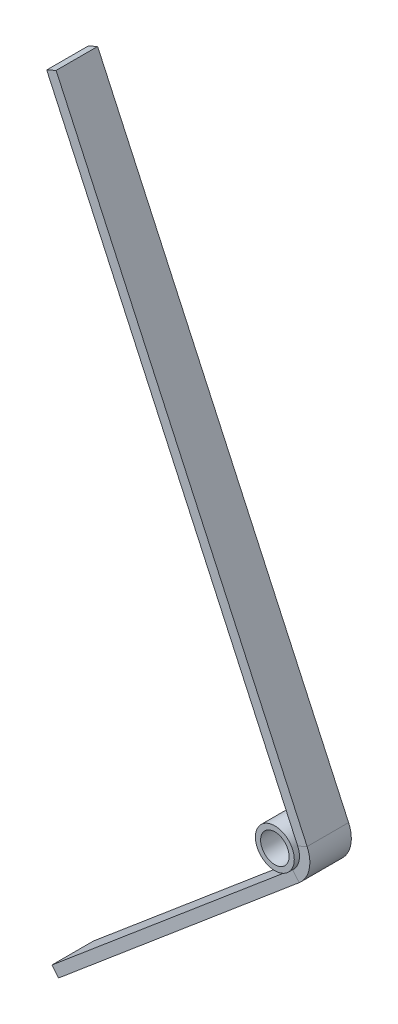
ISO-10303-21;
HEADER;
FILE_DESCRIPTION(('STEP AP214'),'2;1');
FILE_NAME('part.step','',(''),(''),'','','');
FILE_SCHEMA(('AUTOMOTIVE_DESIGN { 1 0 10303 214 1 1 1 1 }'));
ENDSEC;
DATA;
#1=APPLICATION_CONTEXT('core data for automotive mechanical design processes');
#2=APPLICATION_PROTOCOL_DEFINITION('international standard','automotive_design',2000,#1);
#3=PRODUCT_CONTEXT('',#1,'mechanical');
#4=PRODUCT('Part','Part','',(#3));
#5=PRODUCT_RELATED_PRODUCT_CATEGORY('part','',(#4));
#6=PRODUCT_DEFINITION_FORMATION('','',#4);
#7=PRODUCT_DEFINITION_CONTEXT('part definition',#1,'design');
#8=PRODUCT_DEFINITION('design','',#6,#7);
#9=PRODUCT_DEFINITION_SHAPE('','',#8);
#10=(LENGTH_UNIT() NAMED_UNIT(*) SI_UNIT(.MILLI.,.METRE.));
#11=(NAMED_UNIT(*) PLANE_ANGLE_UNIT() SI_UNIT($,.RADIAN.));
#12=(NAMED_UNIT(*) SI_UNIT($,.STERADIAN.) SOLID_ANGLE_UNIT());
#13=UNCERTAINTY_MEASURE_WITH_UNIT(LENGTH_MEASURE(1.E-05),#10,'distance_accuracy_value','');
#14=(GEOMETRIC_REPRESENTATION_CONTEXT(3) GLOBAL_UNCERTAINTY_ASSIGNED_CONTEXT((#13)) GLOBAL_UNIT_ASSIGNED_CONTEXT((#10,
#11,#12)) REPRESENTATION_CONTEXT('',''));
#15=CARTESIAN_POINT('',(0.,0.,0.));
#16=DIRECTION('',(0.,0.,1.));
#17=DIRECTION('',(1.,0.,0.));
#18=AXIS2_PLACEMENT_3D('',#15,#16,#17);
#19=CARTESIAN_POINT('',(10.8203069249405,4.96787148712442,12.7));
#20=DIRECTION('',(0.,0.,1.));
#21=DIRECTION('',(1.,0.,0.));
#22=AXIS2_PLACEMENT_3D('',#19,#20,#21);
#23=PLANE('',#22);
#24=DIRECTION('',(0.908792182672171,0.417249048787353,0.));
#25=VECTOR('',#24,1.);
#26=CARTESIAN_POINT('',(10.8203069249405,4.96787148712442,12.7));
#27=LINE('',#26,#25);
#28=CARTESIAN_POINT('',(10.8203069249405,4.96787148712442,12.7));
#29=VERTEX_POINT('',#28);
#30=CARTESIAN_POINT('',(16.5911372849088,7.61740294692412,12.7));
#31=VERTEX_POINT('',#30);
#32=EDGE_CURVE('E12',#29,#31,#27,.T.);
#33=ORIENTED_EDGE('',*,*,#32,.F.);
#34=CARTESIAN_POINT('',(0.,0.,12.7));
#35=DIRECTION('',(0.,0.,-1.));
#36=DIRECTION('',(1.,0.,0.));
#37=AXIS2_PLACEMENT_3D('',#34,#35,#36);
#38=CIRCLE('',#37,11.90625);
#39=CARTESIAN_POINT('',(7.67438496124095,-9.1028898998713,12.7));
#40=VERTEX_POINT('',#39);
#41=EDGE_CURVE('E141',#29,#40,#38,.T.);
#42=ORIENTED_EDGE('',*,*,#41,.T.);
#43=DIRECTION('',(-0.644567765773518,0.764547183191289,0.));
#44=VECTOR('',#43,1.);
#45=CARTESIAN_POINT('',(11.7673902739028,-13.957764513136,12.7));
#46=LINE('',#45,#44);
#47=CARTESIAN_POINT('',(11.7673902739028,-13.957764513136,12.7));
#48=VERTEX_POINT('',#47);
#49=EDGE_CURVE('E62',#48,#40,#46,.T.);
#50=ORIENTED_EDGE('',*,*,#49,.F.);
#51=CARTESIAN_POINT('',(0.,0.,12.7));
#52=DIRECTION('',(0.,0.,1.));
#53=DIRECTION('',(1.,0.,0.));
#54=AXIS2_PLACEMENT_3D('',#51,#52,#53);
#55=CIRCLE('',#54,18.25625);
#56=EDGE_CURVE('E148',#31,#48,#55,.F.);
#57=ORIENTED_EDGE('',*,*,#56,.F.);
#58=EDGE_LOOP('',(#33,#42,#50,#57));
#59=FACE_BOUND('',#58,.T.);
#60=ADVANCED_FACE('F52',(#59),#23,.T.);
#61=CARTESIAN_POINT('',(11.7673902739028,-13.957764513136,12.7));
#62=DIRECTION('',(0.,0.,1.));
#63=DIRECTION('',(1.,0.,0.));
#64=AXIS2_PLACEMENT_3D('',#61,#62,#63);
#65=PLANE('',#64);
#66=DIRECTION('',(0.41724904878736,-0.908792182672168,0.));
#67=VECTOR('',#66,1.);
#68=CARTESIAN_POINT('',(10.8203069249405,4.96787148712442,12.7));
#69=LINE('',#68,#67);
#70=CARTESIAN_POINT('',(-142.875,339.725,12.7));
#71=VERTEX_POINT('',#70);
#72=EDGE_CURVE('E136',#71,#29,#69,.T.);
#73=ORIENTED_EDGE('',*,*,#72,.T.);
#74=ORIENTED_EDGE('',*,*,#32,.T.);
#75=DIRECTION('',(0.41724904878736,-0.908792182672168,0.));
#76=VECTOR('',#75,1.);
#77=CARTESIAN_POINT('',(16.5911372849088,7.61740294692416,12.7));
#78=LINE('',#77,#76);
#79=CARTESIAN_POINT('',(-137.104169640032,342.3745314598,12.7));
#80=VERTEX_POINT('',#79);
#81=EDGE_CURVE('E149',#80,#31,#78,.T.);
#82=ORIENTED_EDGE('',*,*,#81,.F.);
#83=DIRECTION('',(0.908792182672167,0.417249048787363,0.));
#84=VECTOR('',#83,1.);
#85=CARTESIAN_POINT('',(-142.875,339.725,12.7));
#86=LINE('',#85,#84);
#87=EDGE_CURVE('E126',#71,#80,#86,.T.);
#88=ORIENTED_EDGE('',*,*,#87,.F.);
#89=EDGE_LOOP('',(#73,#74,#82,#88));
#90=FACE_BOUND('',#89,.T.);
#91=ADVANCED_FACE('F147',(#90),#65,.T.);
#92=CARTESIAN_POINT('',(7.67438496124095,-9.1028898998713,-12.7));
#93=DIRECTION('',(0.,0.,-1.));
#94=DIRECTION('',(-1.,0.,0.));
#95=AXIS2_PLACEMENT_3D('',#92,#93,#94);
#96=PLANE('',#95);
#97=DIRECTION('',(0.644567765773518,-0.764547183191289,0.));
#98=VECTOR('',#97,1.);
#99=CARTESIAN_POINT('',(7.67438496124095,-9.1028898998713,-12.7));
#100=LINE('',#99,#98);
#101=CARTESIAN_POINT('',(7.67438496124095,-9.1028898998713,-12.7));
#102=VERTEX_POINT('',#101);
#103=CARTESIAN_POINT('',(11.7673902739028,-13.957764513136,-12.7));
#104=VERTEX_POINT('',#103);
#105=EDGE_CURVE('E104',#102,#104,#100,.T.);
#106=ORIENTED_EDGE('',*,*,#105,.F.);
#107=CARTESIAN_POINT('',(0.,0.,-12.7));
#108=DIRECTION('',(0.,0.,-1.));
#109=DIRECTION('',(1.,0.,0.));
#110=AXIS2_PLACEMENT_3D('',#107,#108,#109);
#111=CIRCLE('',#110,11.90625);
#112=CARTESIAN_POINT('',(10.8203069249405,4.96787148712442,-12.7));
#113=VERTEX_POINT('',#112);
#114=EDGE_CURVE('E175',#113,#102,#111,.T.);
#115=ORIENTED_EDGE('',*,*,#114,.F.);
#116=DIRECTION('',(-0.908792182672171,-0.417249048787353,0.));
#117=VECTOR('',#116,1.);
#118=CARTESIAN_POINT('',(16.5911372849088,7.61740294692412,-12.7));
#119=LINE('',#118,#117);
#120=CARTESIAN_POINT('',(16.5911372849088,7.61740294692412,-12.7));
#121=VERTEX_POINT('',#120);
#122=EDGE_CURVE('E97',#121,#113,#119,.T.);
#123=ORIENTED_EDGE('',*,*,#122,.F.);
#124=CARTESIAN_POINT('',(0.,0.,-12.7));
#125=DIRECTION('',(0.,0.,1.));
#126=DIRECTION('',(1.,0.,0.));
#127=AXIS2_PLACEMENT_3D('',#124,#125,#126);
#128=CIRCLE('',#127,18.25625);
#129=EDGE_CURVE('E164',#121,#104,#128,.F.);
#130=ORIENTED_EDGE('',*,*,#129,.T.);
#131=EDGE_LOOP('',(#106,#115,#123,#130));
#132=FACE_BOUND('',#131,.T.);
#133=ADVANCED_FACE('F202',(#132),#96,.T.);
#134=CARTESIAN_POINT('',(16.5911372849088,7.61740294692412,-12.7));
#135=DIRECTION('',(0.,0.,-1.));
#136=DIRECTION('',(-1.,0.,0.));
#137=AXIS2_PLACEMENT_3D('',#134,#135,#136);
#138=PLANE('',#137);
#139=DIRECTION('',(-0.764547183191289,-0.644567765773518,0.));
#140=VECTOR('',#139,1.);
#141=CARTESIAN_POINT('',(7.67438496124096,-9.1028898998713,-12.7));
#142=LINE('',#141,#140);
#143=CARTESIAN_POINT('',(-139.699999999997,-133.35,-12.7));
#144=VERTEX_POINT('',#143);
#145=EDGE_CURVE('E158',#102,#144,#142,.T.);
#146=ORIENTED_EDGE('',*,*,#145,.F.);
#147=ORIENTED_EDGE('',*,*,#105,.T.);
#148=DIRECTION('',(-0.764547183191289,-0.644567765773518,0.));
#149=VECTOR('',#148,1.);
#150=CARTESIAN_POINT('',(11.7673902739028,-13.957764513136,-12.7));
#151=LINE('',#150,#149);
#152=CARTESIAN_POINT('',(-135.606994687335,-138.204874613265,-12.7));
#153=VERTEX_POINT('',#152);
#154=EDGE_CURVE('E162',#104,#153,#151,.T.);
#155=ORIENTED_EDGE('',*,*,#154,.T.);
#156=DIRECTION('',(-0.644567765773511,0.764547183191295,0.));
#157=VECTOR('',#156,1.);
#158=CARTESIAN_POINT('',(-135.606994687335,-138.204874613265,-12.7));
#159=LINE('',#158,#157);
#160=EDGE_CURVE('E159',#153,#144,#159,.T.);
#161=ORIENTED_EDGE('',*,*,#160,.T.);
#162=EDGE_LOOP('',(#146,#147,#155,#161));
#163=FACE_BOUND('',#162,.T.);
#164=ADVANCED_FACE('F192',(#163),#138,.T.);
#165=CARTESIAN_POINT('',(7.67438496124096,-9.1028898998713,12.7));
#166=DIRECTION('',(0.644567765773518,-0.764547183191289,0.));
#167=DIRECTION('',(0.764547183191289,0.644567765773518,0.));
#168=AXIS2_PLACEMENT_3D('',#165,#166,#167);
#169=PLANE('',#168);
#170=ORIENTED_EDGE('',*,*,#145,.T.);
#171=DIRECTION('',(0.,0.,-1.));
#172=VECTOR('',#171,1.);
#173=CARTESIAN_POINT('',(-139.699999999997,-133.35,12.7));
#174=LINE('',#173,#172);
#175=CARTESIAN_POINT('',(-139.699999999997,-133.35,12.7));
#176=VERTEX_POINT('',#175);
#177=EDGE_CURVE('E187',#176,#144,#174,.T.);
#178=ORIENTED_EDGE('',*,*,#177,.F.);
#179=DIRECTION('',(-0.764547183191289,-0.644567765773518,0.));
#180=VECTOR('',#179,1.);
#181=CARTESIAN_POINT('',(7.67438496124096,-9.1028898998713,12.7));
#182=LINE('',#181,#180);
#183=EDGE_CURVE('E109',#40,#176,#182,.T.);
#184=ORIENTED_EDGE('',*,*,#183,.F.);
#185=DIRECTION('',(0.,0.,-1.));
#186=VECTOR('',#185,1.);
#187=CARTESIAN_POINT('',(7.67438496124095,-9.1028898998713,12.7));
#188=LINE('',#187,#186);
#189=EDGE_CURVE('E153',#40,#102,#188,.T.);
#190=ORIENTED_EDGE('',*,*,#189,.T.);
#191=EDGE_LOOP('',(#170,#178,#184,#190));
#192=FACE_BOUND('',#191,.T.);
#193=ADVANCED_FACE('F239',(#192),#169,.F.);
#194=CARTESIAN_POINT('',(-135.606994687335,-138.204874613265,12.7));
#195=DIRECTION('',(-0.764547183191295,-0.644567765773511,0.));
#196=DIRECTION('',(0.644567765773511,-0.764547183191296,0.));
#197=AXIS2_PLACEMENT_3D('',#194,#195,#196);
#198=PLANE('',#197);
#199=ORIENTED_EDGE('',*,*,#160,.F.);
#200=DIRECTION('',(0.,0.,-1.));
#201=VECTOR('',#200,1.);
#202=CARTESIAN_POINT('',(-135.606994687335,-138.204874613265,12.7));
#203=LINE('',#202,#201);
#204=CARTESIAN_POINT('',(-135.606994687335,-138.204874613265,12.7));
#205=VERTEX_POINT('',#204);
#206=EDGE_CURVE('E183',#205,#153,#203,.T.);
#207=ORIENTED_EDGE('',*,*,#206,.F.);
#208=DIRECTION('',(-0.644567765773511,0.764547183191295,0.));
#209=VECTOR('',#208,1.);
#210=CARTESIAN_POINT('',(-135.606994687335,-138.204874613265,12.7));
#211=LINE('',#210,#209);
#212=EDGE_CURVE('E208',#205,#176,#211,.T.);
#213=ORIENTED_EDGE('',*,*,#212,.T.);
#214=ORIENTED_EDGE('',*,*,#177,.T.);
#215=EDGE_LOOP('',(#199,#207,#213,#214));
#216=FACE_BOUND('',#215,.T.);
#217=ADVANCED_FACE('F217',(#216),#198,.T.);
#218=CARTESIAN_POINT('',(11.7673902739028,-13.957764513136,12.7));
#219=DIRECTION('',(0.644567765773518,-0.764547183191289,0.));
#220=DIRECTION('',(0.764547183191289,0.644567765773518,0.));
#221=AXIS2_PLACEMENT_3D('',#218,#219,#220);
#222=PLANE('',#221);
#223=ORIENTED_EDGE('',*,*,#154,.F.);
#224=DIRECTION('',(0.,0.,-1.));
#225=VECTOR('',#224,1.);
#226=CARTESIAN_POINT('',(11.7673902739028,-13.957764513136,12.7));
#227=LINE('',#226,#225);
#228=EDGE_CURVE('E181',#48,#104,#227,.T.);
#229=ORIENTED_EDGE('',*,*,#228,.F.);
#230=DIRECTION('',(-0.764547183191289,-0.644567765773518,0.));
#231=VECTOR('',#230,1.);
#232=CARTESIAN_POINT('',(11.7673902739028,-13.957764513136,12.7));
#233=LINE('',#232,#231);
#234=EDGE_CURVE('E209',#48,#205,#233,.T.);
#235=ORIENTED_EDGE('',*,*,#234,.T.);
#236=ORIENTED_EDGE('',*,*,#206,.T.);
#237=EDGE_LOOP('',(#223,#229,#235,#236));
#238=FACE_BOUND('',#237,.T.);
#239=ADVANCED_FACE('F205',(#238),#222,.T.);
#240=CARTESIAN_POINT('',(0.,0.,12.7));
#241=DIRECTION('',(0.,0.,-1.));
#242=DIRECTION('',(-1.,0.,0.));
#243=AXIS2_PLACEMENT_3D('',#240,#241,#242);
#244=CYLINDRICAL_SURFACE('',#243,18.25625);
#245=ORIENTED_EDGE('',*,*,#129,.F.);
#246=DIRECTION('',(0.,0.,-1.));
#247=VECTOR('',#246,1.);
#248=CARTESIAN_POINT('',(16.5911372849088,7.61740294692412,12.7));
#249=LINE('',#248,#247);
#250=EDGE_CURVE('E178',#31,#121,#249,.T.);
#251=ORIENTED_EDGE('',*,*,#250,.F.);
#252=ORIENTED_EDGE('',*,*,#56,.T.);
#253=ORIENTED_EDGE('',*,*,#228,.T.);
#254=EDGE_LOOP('',(#245,#251,#252,#253));
#255=FACE_BOUND('',#254,.T.);
#256=ADVANCED_FACE('F199',(#255),#244,.T.);
#257=CARTESIAN_POINT('',(16.5911372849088,7.61740294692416,12.7));
#258=DIRECTION('',(0.908792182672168,0.41724904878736,0.));
#259=DIRECTION('',(-0.41724904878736,0.908792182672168,0.));
#260=AXIS2_PLACEMENT_3D('',#257,#258,#259);
#261=PLANE('',#260);
#262=DIRECTION('',(0.41724904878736,-0.908792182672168,0.));
#263=VECTOR('',#262,1.);
#264=CARTESIAN_POINT('',(16.5911372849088,7.61740294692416,-12.7));
#265=LINE('',#264,#263);
#266=CARTESIAN_POINT('',(-137.104169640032,342.3745314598,-12.7));
#267=VERTEX_POINT('',#266);
#268=EDGE_CURVE('E170',#267,#121,#265,.T.);
#269=ORIENTED_EDGE('',*,*,#268,.F.);
#270=DIRECTION('',(0.,0.,-1.));
#271=VECTOR('',#270,1.);
#272=CARTESIAN_POINT('',(-137.104169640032,342.3745314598,12.7));
#273=LINE('',#272,#271);
#274=EDGE_CURVE('E135',#80,#267,#273,.T.);
#275=ORIENTED_EDGE('',*,*,#274,.F.);
#276=ORIENTED_EDGE('',*,*,#81,.T.);
#277=ORIENTED_EDGE('',*,*,#250,.T.);
#278=EDGE_LOOP('',(#269,#275,#276,#277));
#279=FACE_BOUND('',#278,.T.);
#280=ADVANCED_FACE('F210',(#279),#261,.T.);
#281=CARTESIAN_POINT('',(-142.875,339.725,12.7));
#282=DIRECTION('',(-0.417249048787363,0.908792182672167,0.));
#283=DIRECTION('',(-0.908792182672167,-0.417249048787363,0.));
#284=AXIS2_PLACEMENT_3D('',#281,#282,#283);
#285=PLANE('',#284);
#286=DIRECTION('',(0.908792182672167,0.417249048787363,0.));
#287=VECTOR('',#286,1.);
#288=CARTESIAN_POINT('',(-142.875,339.725,-12.7));
#289=LINE('',#288,#287);
#290=CARTESIAN_POINT('',(-142.875,339.725,-12.7));
#291=VERTEX_POINT('',#290);
#292=EDGE_CURVE('E132',#291,#267,#289,.T.);
#293=ORIENTED_EDGE('',*,*,#292,.F.);
#294=DIRECTION('',(0.,0.,-1.));
#295=VECTOR('',#294,1.);
#296=CARTESIAN_POINT('',(-142.875,339.725,12.7));
#297=LINE('',#296,#295);
#298=EDGE_CURVE('E123',#71,#291,#297,.T.);
#299=ORIENTED_EDGE('',*,*,#298,.F.);
#300=ORIENTED_EDGE('',*,*,#87,.T.);
#301=ORIENTED_EDGE('',*,*,#274,.T.);
#302=EDGE_LOOP('',(#293,#299,#300,#301));
#303=FACE_BOUND('',#302,.T.);
#304=ADVANCED_FACE('F130',(#303),#285,.T.);
#305=CARTESIAN_POINT('',(10.8203069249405,4.96787148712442,12.7));
#306=DIRECTION('',(0.908792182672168,0.41724904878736,0.));
#307=DIRECTION('',(-0.41724904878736,0.908792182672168,0.));
#308=AXIS2_PLACEMENT_3D('',#305,#306,#307);
#309=PLANE('',#308);
#310=DIRECTION('',(0.41724904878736,-0.908792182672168,0.));
#311=VECTOR('',#310,1.);
#312=CARTESIAN_POINT('',(10.8203069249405,4.96787148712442,-12.7));
#313=LINE('',#312,#311);
#314=EDGE_CURVE('E167',#291,#113,#313,.T.);
#315=ORIENTED_EDGE('',*,*,#314,.T.);
#316=DIRECTION('',(0.,0.,-1.));
#317=VECTOR('',#316,1.);
#318=CARTESIAN_POINT('',(10.8203069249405,4.96787148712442,12.7));
#319=LINE('',#318,#317);
#320=EDGE_CURVE('E131',#29,#113,#319,.T.);
#321=ORIENTED_EDGE('',*,*,#320,.F.);
#322=ORIENTED_EDGE('',*,*,#72,.F.);
#323=ORIENTED_EDGE('',*,*,#298,.T.);
#324=EDGE_LOOP('',(#315,#321,#322,#323));
#325=FACE_BOUND('',#324,.T.);
#326=ADVANCED_FACE('F137',(#325),#309,.F.);
#327=CARTESIAN_POINT('',(0.,0.,12.7));
#328=DIRECTION('',(0.,0.,-1.));
#329=DIRECTION('',(-1.,0.,0.));
#330=AXIS2_PLACEMENT_3D('',#327,#328,#329);
#331=CYLINDRICAL_SURFACE('',#330,11.90625);
#332=ORIENTED_EDGE('',*,*,#114,.T.);
#333=ORIENTED_EDGE('',*,*,#189,.F.);
#334=ORIENTED_EDGE('',*,*,#41,.F.);
#335=ORIENTED_EDGE('',*,*,#320,.T.);
#336=EDGE_LOOP('',(#332,#333,#334,#335));
#337=FACE_BOUND('',#336,.T.);
#338=ADVANCED_FACE('F218',(#337),#331,.F.);
#339=CARTESIAN_POINT('',(0.,0.,12.7));
#340=DIRECTION('',(0.,0.,1.));
#341=DIRECTION('',(1.,0.,0.));
#342=AXIS2_PLACEMENT_3D('',#339,#340,#341);
#343=PLANE('',#342);
#344=ORIENTED_EDGE('',*,*,#183,.T.);
#345=ORIENTED_EDGE('',*,*,#212,.F.);
#346=ORIENTED_EDGE('',*,*,#234,.F.);
#347=ORIENTED_EDGE('',*,*,#49,.T.);
#348=EDGE_LOOP('',(#344,#345,#346,#347));
#349=FACE_BOUND('',#348,.T.);
#350=ADVANCED_FACE('F219',(#349),#343,.T.);
#351=CARTESIAN_POINT('',(0.,0.,-12.7));
#352=DIRECTION('',(0.,0.,1.));
#353=DIRECTION('',(1.,0.,0.));
#354=AXIS2_PLACEMENT_3D('',#351,#352,#353);
#355=PLANE('',#354);
#356=ORIENTED_EDGE('',*,*,#268,.T.);
#357=ORIENTED_EDGE('',*,*,#122,.T.);
#358=ORIENTED_EDGE('',*,*,#314,.F.);
#359=ORIENTED_EDGE('',*,*,#292,.T.);
#360=EDGE_LOOP('',(#356,#357,#358,#359));
#361=FACE_BOUND('',#360,.T.);
#362=ADVANCED_FACE('F216',(#361),#355,.F.);
#363=CLOSED_SHELL('',(#60,#91,#133,#164,#193,#217,#239,#256,#280,#304,#326,#338,#350,#362));
#364=MANIFOLD_SOLID_BREP('B2',#363);
#365=CARTESIAN_POINT('',(0.,0.,15.875));
#366=DIRECTION('',(0.,0.,1.));
#367=DIRECTION('',(1.,0.,0.));
#368=AXIS2_PLACEMENT_3D('',#365,#366,#367);
#369=PLANE('',#368);
#370=CARTESIAN_POINT('',(0.,0.,15.875));
#371=DIRECTION('',(0.,0.,1.));
#372=DIRECTION('',(1.,0.,0.));
#373=AXIS2_PLACEMENT_3D('',#370,#371,#372);
#374=CIRCLE('',#373,11.90625);
#375=CARTESIAN_POINT('',(11.90625,0.,15.875));
#376=VERTEX_POINT('',#375);
#377=EDGE_CURVE('E55',#376,#376,#374,.T.);
#378=ORIENTED_EDGE('',*,*,#377,.T.);
#379=EDGE_LOOP('',(#378));
#380=FACE_BOUND('',#379,.T.);
#381=CARTESIAN_POINT('',(0.,0.,15.875));
#382=DIRECTION('',(0.,0.,1.));
#383=DIRECTION('',(1.,0.,0.));
#384=AXIS2_PLACEMENT_3D('',#381,#382,#383);
#385=CIRCLE('',#384,8.73125);
#386=CARTESIAN_POINT('',(8.73125,0.,15.875));
#387=VERTEX_POINT('',#386);
#388=EDGE_CURVE('E350',#387,#387,#385,.T.);
#389=ORIENTED_EDGE('',*,*,#388,.F.);
#390=EDGE_LOOP('',(#389));
#391=FACE_BOUND('',#390,.T.);
#392=ADVANCED_FACE('F340',(#380,#391),#369,.T.);
#393=CARTESIAN_POINT('',(0.,0.,-15.875));
#394=DIRECTION('',(0.,0.,1.));
#395=DIRECTION('',(1.,0.,0.));
#396=AXIS2_PLACEMENT_3D('',#393,#394,#395);
#397=PLANE('',#396);
#398=CARTESIAN_POINT('',(0.,0.,-15.875));
#399=DIRECTION('',(0.,0.,1.));
#400=DIRECTION('',(1.,0.,0.));
#401=AXIS2_PLACEMENT_3D('',#398,#399,#400);
#402=CIRCLE('',#401,11.90625);
#403=CARTESIAN_POINT('',(11.90625,0.,-15.875));
#404=VERTEX_POINT('',#403);
#405=EDGE_CURVE('E342',#404,#404,#402,.T.);
#406=ORIENTED_EDGE('',*,*,#405,.F.);
#407=EDGE_LOOP('',(#406));
#408=FACE_BOUND('',#407,.T.);
#409=CARTESIAN_POINT('',(0.,0.,-15.875));
#410=DIRECTION('',(0.,0.,1.));
#411=DIRECTION('',(1.,0.,0.));
#412=AXIS2_PLACEMENT_3D('',#409,#410,#411);
#413=CIRCLE('',#412,8.73125);
#414=CARTESIAN_POINT('',(8.73125,0.,-15.875));
#415=VERTEX_POINT('',#414);
#416=EDGE_CURVE('E348',#415,#415,#413,.T.);
#417=ORIENTED_EDGE('',*,*,#416,.T.);
#418=EDGE_LOOP('',(#417));
#419=FACE_BOUND('',#418,.T.);
#420=ADVANCED_FACE('F359',(#408,#419),#397,.F.);
#421=CARTESIAN_POINT('',(0.,0.,15.875));
#422=DIRECTION('',(0.,0.,-1.));
#423=DIRECTION('',(-1.,0.,0.));
#424=AXIS2_PLACEMENT_3D('',#421,#422,#423);
#425=CYLINDRICAL_SURFACE('',#424,11.90625);
#426=ORIENTED_EDGE('',*,*,#377,.F.);
#427=EDGE_LOOP('',(#426));
#428=FACE_BOUND('',#427,.T.);
#429=ORIENTED_EDGE('',*,*,#405,.T.);
#430=EDGE_LOOP('',(#429));
#431=FACE_BOUND('',#430,.T.);
#432=ADVANCED_FACE('F339',(#428,#431),#425,.T.);
#433=CARTESIAN_POINT('',(0.,0.,15.875));
#434=DIRECTION('',(0.,0.,-1.));
#435=DIRECTION('',(-1.,0.,0.));
#436=AXIS2_PLACEMENT_3D('',#433,#434,#435);
#437=CYLINDRICAL_SURFACE('',#436,8.73125);
#438=ORIENTED_EDGE('',*,*,#388,.T.);
#439=EDGE_LOOP('',(#438));
#440=FACE_BOUND('',#439,.T.);
#441=ORIENTED_EDGE('',*,*,#416,.F.);
#442=EDGE_LOOP('',(#441));
#443=FACE_BOUND('',#442,.T.);
#444=ADVANCED_FACE('F358',(#440,#443),#437,.F.);
#445=CLOSED_SHELL('',(#392,#420,#432,#444));
#446=MANIFOLD_SOLID_BREP('B6',#445);
#447=ADVANCED_BREP_SHAPE_REPRESENTATION('',(#18,#364,#446),#14);
#448=SHAPE_DEFINITION_REPRESENTATION(#9,#447);
ENDSEC;
END-ISO-10303-21;
